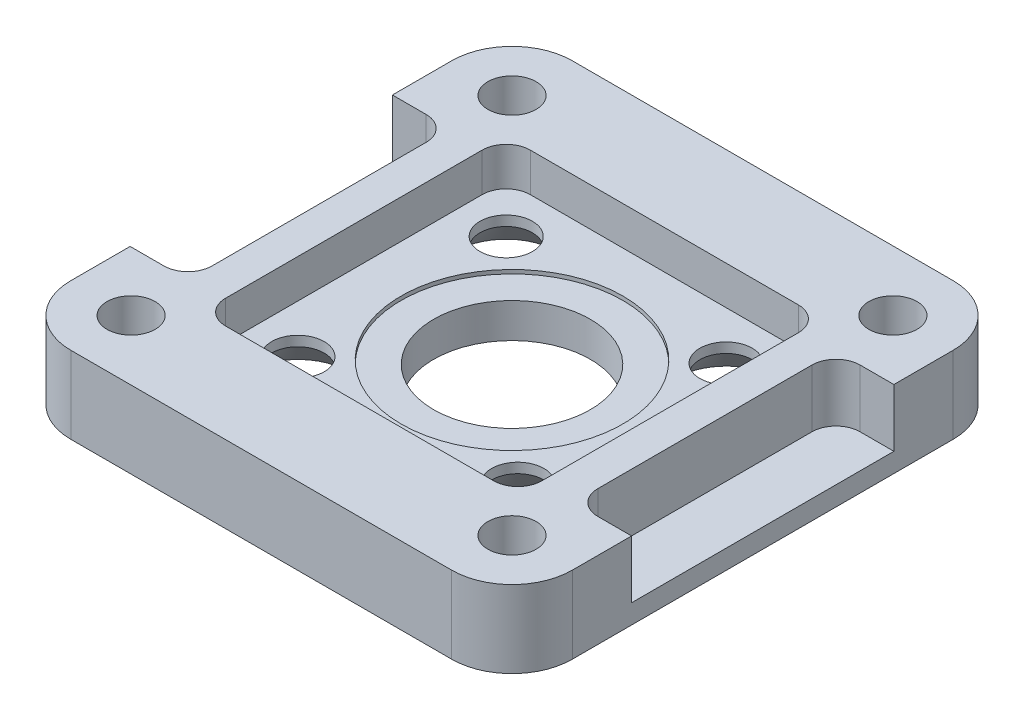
from build123d import *

# Parameters (mm, degrees)
SKETCH1_W                                      = 33.02
SKETCH1_H                                      = 33.02
BOSS_EXTRUDE1_DEPTH                            = 5.08
CUT_EXTRUDE1_DEPTH                             = 2.54
CSK_FOR_4_FLAT_HEAD_MACHINE_SCREW1_D           = 3.4544
CSK_FOR_4_FLAT_HEAD_MACHINE_SCREW1_CSINK_D     = 6.731
CSK_FOR_4_FLAT_HEAD_MACHINE_SCREW1_CSINK_ANGLE = 82
F_1_8_0_125_DIAMETER_HOLE1_D                   = 3.175
FILLET1_R                                      = 3.96875
CUT_EXTRUDE2_DEPTH                             = 3.81
HOLE1_D                                        = 10.31875
HOLE1_CBORE_D                                  = 14.605
HOLE1_CBORE_DEPTH                              = 0.254


with BuildPart() as part:
    # Sketch1 → Boss-Extrude1 (new body)
    with BuildSketch(Plane(origin=(0, 0, 0), x_dir=(1, 0, 0), z_dir=(0, 1, 0))):
        Rectangle(SKETCH1_W, SKETCH1_H)
    extrude(amount=BOSS_EXTRUDE1_DEPTH)

    # Sketch6 → Cut-Extrude1 (cut)
    with BuildSketch(Plane.XZ.offset(-5.08)):
        with BuildLine():
            Line((8.8265, -10.033), (-8.8265, -10.033))
            ThreePointArc((-8.8265, -10.033), (-9.949032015, -9.568032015), (-10.414, -8.4455))
            Line((-10.414, -8.4455), (-10.414, 8.4455))
            ThreePointArc((-10.414, 8.4455), (-9.949032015, 9.568032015), (-8.8265, 10.033))
            Line((-8.8265, 10.033), (8.8265, 10.033))
            ThreePointArc((8.8265, 10.033), (9.949032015, 9.568032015), (10.414, 8.4455))
            Line((10.414, 8.4455), (10.414, -8.4455))
            ThreePointArc((10.414, -8.4455), (9.949032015, -9.568032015), (8.8265, -10.033))
        make_face()
    extrude(amount=CUT_EXTRUDE1_DEPTH, mode=Mode.SUBTRACT)

    # CSK for _4 Flat Head Machine Screw1 (through all)
    with Locations(Plane.XZ):
        with Locations((-7.239, 6.858), (-7.239, -6.858), (7.239, -6.858), (7.239, 6.858)):
            CounterSinkHole(CSK_FOR_4_FLAT_HEAD_MACHINE_SCREW1_D / 2, CSK_FOR_4_FLAT_HEAD_MACHINE_SCREW1_CSINK_D / 2, counter_sink_angle=CSK_FOR_4_FLAT_HEAD_MACHINE_SCREW1_CSINK_ANGLE)

    # 1_8 _0.125_ Diameter Hole1 (through all)
    with Locations(Plane(origin=(0, 5.08, 0), x_dir=(1, 0, 0), z_dir=(0, 1, 0))):
        with Locations((-12.54125, 12.54125), (12.54125, 12.54125), (12.54125, -12.54125), (-12.54125, -12.54125)):
            Hole(F_1_8_0_125_DIAMETER_HOLE1_D / 2)

    # Fillet1
    fillet1_edges = [part.edges().sort_by_distance(p)[0] for p in [
        (16.51, 2.54, -16.51),
        (16.51, 2.54, 16.51),
        (-16.51, 2.54, 16.51),
        (-16.51, 2.54, -16.51),
    ]]
    fillet(fillet1_edges, radius=FILLET1_R)

    # Sketch7 → Cut-Extrude2 (cut)
    with BuildSketch(Plane(origin=(0, 5.08, 0), x_dir=(1, 0, 0), z_dir=(0, 1, 0))):
        with BuildLine():
            Line((-16.51, 8.636), (-14.2875, 8.636))
            ThreePointArc((-14.2875, 8.636), (-13.164967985, 8.171032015), (-12.7, 7.0485))
            Line((-12.7, 7.0485), (-12.7, -7.0485))
            ThreePointArc((-12.7, -7.0485), (-13.164967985, -8.171032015), (-14.2875, -8.636))
            Line((-14.2875, -8.636), (-16.51, -8.636))
            Line((-16.51, -8.636), (-16.51, 8.636))
        make_face()
        with BuildLine():
            Line((16.51, 8.636), (14.2875, 8.636))
            ThreePointArc((14.2875, 8.636), (13.164967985, 8.171032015), (12.7, 7.0485))
            Line((12.7, 7.0485), (12.7, -7.0485))
            ThreePointArc((12.7, -7.0485), (13.164967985, -8.171032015), (14.2875, -8.636))
            Line((14.2875, -8.636), (16.51, -8.636))
            Line((16.51, -8.636), (16.51, 8.636))
        make_face()
    extrude(amount=-CUT_EXTRUDE2_DEPTH, mode=Mode.SUBTRACT)

    # Hole1 (through all)
    with Locations(Plane(origin=(0, 2.54, 0), x_dir=(-1, 0, 0), z_dir=(0, 1, 0))):
        with Locations((0, 0)):
            CounterBoreHole(HOLE1_D / 2, HOLE1_CBORE_D / 2, HOLE1_CBORE_DEPTH)


solid = part.part
